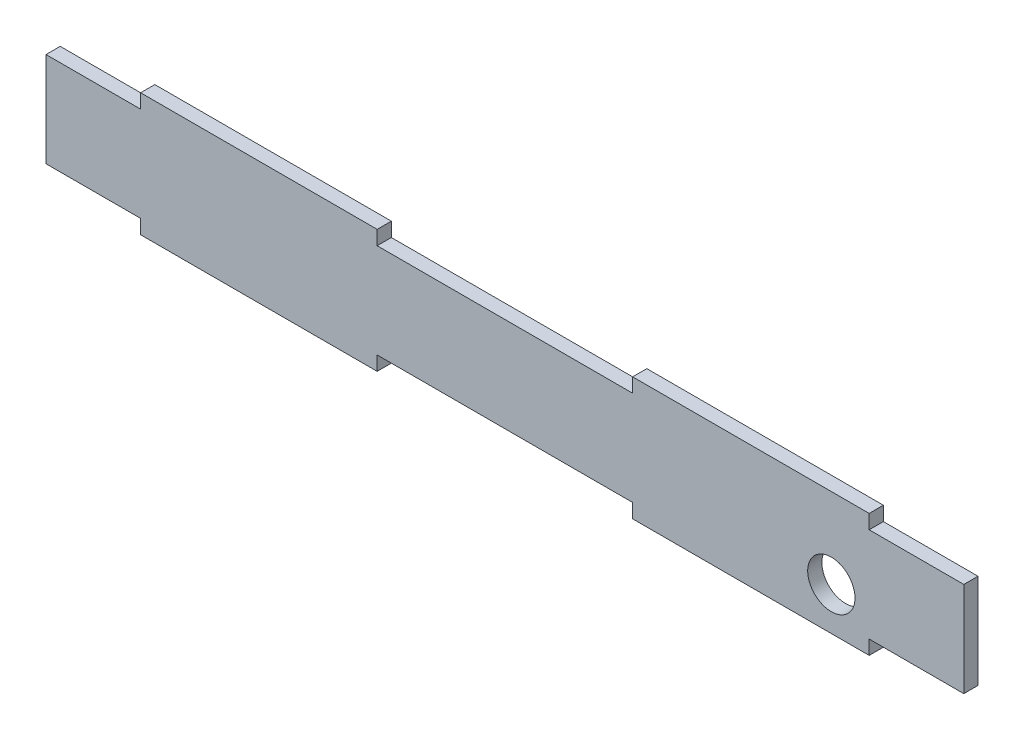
ISO-10303-21;
HEADER;
FILE_DESCRIPTION(('STEP AP214'),'2;1');
FILE_NAME('part.step','',(''),(''),'','','');
FILE_SCHEMA(('AUTOMOTIVE_DESIGN { 1 0 10303 214 1 1 1 1 }'));
ENDSEC;
DATA;
#1=APPLICATION_CONTEXT('core data for automotive mechanical design processes');
#2=APPLICATION_PROTOCOL_DEFINITION('international standard','automotive_design',2000,#1);
#3=PRODUCT_CONTEXT('',#1,'mechanical');
#4=PRODUCT('Part','Part','',(#3));
#5=PRODUCT_RELATED_PRODUCT_CATEGORY('part','',(#4));
#6=PRODUCT_DEFINITION_FORMATION('','',#4);
#7=PRODUCT_DEFINITION_CONTEXT('part definition',#1,'design');
#8=PRODUCT_DEFINITION('design','',#6,#7);
#9=PRODUCT_DEFINITION_SHAPE('','',#8);
#10=(LENGTH_UNIT() NAMED_UNIT(*) SI_UNIT(.MILLI.,.METRE.));
#11=(NAMED_UNIT(*) PLANE_ANGLE_UNIT() SI_UNIT($,.RADIAN.));
#12=(NAMED_UNIT(*) SI_UNIT($,.STERADIAN.) SOLID_ANGLE_UNIT());
#13=UNCERTAINTY_MEASURE_WITH_UNIT(LENGTH_MEASURE(1.E-05),#10,'distance_accuracy_value','');
#14=(GEOMETRIC_REPRESENTATION_CONTEXT(3) GLOBAL_UNCERTAINTY_ASSIGNED_CONTEXT((#13)) GLOBAL_UNIT_ASSIGNED_CONTEXT((#10,
#11,#12)) REPRESENTATION_CONTEXT('',''));
#15=CARTESIAN_POINT('',(0.,0.,0.));
#16=DIRECTION('',(0.,0.,1.));
#17=DIRECTION('',(1.,0.,0.));
#18=AXIS2_PLACEMENT_3D('',#15,#16,#17);
#19=CARTESIAN_POINT('',(166.,6.,3.));
#20=DIRECTION('',(0.,0.,-1.));
#21=DIRECTION('',(-1.,0.,0.));
#22=AXIS2_PLACEMENT_3D('',#19,#20,#21);
#23=CYLINDRICAL_SURFACE('',#22,5.00000000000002);
#24=CARTESIAN_POINT('',(166.,6.,3.));
#25=DIRECTION('',(0.,0.,1.));
#26=DIRECTION('',(1.,0.,0.));
#27=AXIS2_PLACEMENT_3D('',#24,#25,#26);
#28=CIRCLE('',#27,5.00000000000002);
#29=CARTESIAN_POINT('',(171.,6.,3.));
#30=VERTEX_POINT('',#29);
#31=EDGE_CURVE('E640',#30,#30,#28,.T.);
#32=ORIENTED_EDGE('',*,*,#31,.T.);
#33=EDGE_LOOP('',(#32));
#34=FACE_BOUND('',#33,.T.);
#35=CARTESIAN_POINT('',(166.,6.,0.));
#36=DIRECTION('',(0.,0.,1.));
#37=DIRECTION('',(1.,0.,0.));
#38=AXIS2_PLACEMENT_3D('',#35,#36,#37);
#39=CIRCLE('',#38,5.00000000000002);
#40=CARTESIAN_POINT('',(171.,6.,0.));
#41=VERTEX_POINT('',#40);
#42=EDGE_CURVE('E269',#41,#41,#39,.T.);
#43=ORIENTED_EDGE('',*,*,#42,.F.);
#44=EDGE_LOOP('',(#43));
#45=FACE_BOUND('',#44,.T.);
#46=ADVANCED_FACE('F97',(#34,#45),#23,.F.);
#47=CARTESIAN_POINT('',(0.,0.,3.));
#48=DIRECTION('',(-1.,0.,0.));
#49=DIRECTION('',(0.,0.,1.));
#50=AXIS2_PLACEMENT_3D('',#47,#48,#49);
#51=PLANE('',#50);
#52=DIRECTION('',(0.,1.,0.));
#53=VECTOR('',#52,1.);
#54=CARTESIAN_POINT('',(0.,0.,0.));
#55=LINE('',#54,#53);
#56=CARTESIAN_POINT('',(0.,0.,0.));
#57=VERTEX_POINT('',#56);
#58=CARTESIAN_POINT('',(0.,20.,0.));
#59=VERTEX_POINT('',#58);
#60=EDGE_CURVE('E266',#57,#59,#55,.T.);
#61=ORIENTED_EDGE('',*,*,#60,.F.);
#62=DIRECTION('',(0.,0.,-1.));
#63=VECTOR('',#62,1.);
#64=CARTESIAN_POINT('',(0.,0.,3.));
#65=LINE('',#64,#63);
#66=CARTESIAN_POINT('',(0.,0.,3.));
#67=VERTEX_POINT('',#66);
#68=EDGE_CURVE('E281',#67,#57,#65,.T.);
#69=ORIENTED_EDGE('',*,*,#68,.F.);
#70=DIRECTION('',(0.,1.,0.));
#71=VECTOR('',#70,1.);
#72=CARTESIAN_POINT('',(0.,0.,3.));
#73=LINE('',#72,#71);
#74=CARTESIAN_POINT('',(0.,20.,3.));
#75=VERTEX_POINT('',#74);
#76=EDGE_CURVE('E277',#67,#75,#73,.T.);
#77=ORIENTED_EDGE('',*,*,#76,.T.);
#78=DIRECTION('',(0.,0.,-1.));
#79=VECTOR('',#78,1.);
#80=CARTESIAN_POINT('',(0.,20.,3.));
#81=LINE('',#80,#79);
#82=EDGE_CURVE('E299',#75,#59,#81,.T.);
#83=ORIENTED_EDGE('',*,*,#82,.T.);
#84=EDGE_LOOP('',(#61,#69,#77,#83));
#85=FACE_BOUND('',#84,.T.);
#86=ADVANCED_FACE('F375',(#85),#51,.T.);
#87=CARTESIAN_POINT('',(194.,0.,3.));
#88=DIRECTION('',(-1.,0.,0.));
#89=DIRECTION('',(0.,0.,1.));
#90=AXIS2_PLACEMENT_3D('',#87,#88,#89);
#91=PLANE('',#90);
#92=DIRECTION('',(0.,1.,0.));
#93=VECTOR('',#92,1.);
#94=CARTESIAN_POINT('',(194.,0.,0.));
#95=LINE('',#94,#93);
#96=CARTESIAN_POINT('',(194.,0.,0.));
#97=VERTEX_POINT('',#96);
#98=CARTESIAN_POINT('',(194.,20.,0.));
#99=VERTEX_POINT('',#98);
#100=EDGE_CURVE('E285',#97,#99,#95,.T.);
#101=ORIENTED_EDGE('',*,*,#100,.T.);
#102=DIRECTION('',(0.,0.,-1.));
#103=VECTOR('',#102,1.);
#104=CARTESIAN_POINT('',(194.,20.,3.));
#105=LINE('',#104,#103);
#106=CARTESIAN_POINT('',(194.,20.,3.));
#107=VERTEX_POINT('',#106);
#108=EDGE_CURVE('E302',#107,#99,#105,.T.);
#109=ORIENTED_EDGE('',*,*,#108,.F.);
#110=DIRECTION('',(0.,1.,0.));
#111=VECTOR('',#110,1.);
#112=CARTESIAN_POINT('',(194.,0.,3.));
#113=LINE('',#112,#111);
#114=CARTESIAN_POINT('',(194.,0.,3.));
#115=VERTEX_POINT('',#114);
#116=EDGE_CURVE('E264',#115,#107,#113,.T.);
#117=ORIENTED_EDGE('',*,*,#116,.F.);
#118=DIRECTION('',(0.,0.,-1.));
#119=VECTOR('',#118,1.);
#120=CARTESIAN_POINT('',(194.,0.,3.));
#121=LINE('',#120,#119);
#122=EDGE_CURVE('E245',#115,#97,#121,.T.);
#123=ORIENTED_EDGE('',*,*,#122,.T.);
#124=EDGE_LOOP('',(#101,#109,#117,#123));
#125=FACE_BOUND('',#124,.T.);
#126=ADVANCED_FACE('F439',(#125),#91,.F.);
#127=CARTESIAN_POINT('',(0.,0.,0.));
#128=DIRECTION('',(0.,0.,1.));
#129=DIRECTION('',(1.,0.,0.));
#130=AXIS2_PLACEMENT_3D('',#127,#128,#129);
#131=PLANE('',#130);
#132=DIRECTION('',(1.,0.,0.));
#133=VECTOR('',#132,1.);
#134=CARTESIAN_POINT('',(0.,0.,0.));
#135=LINE('',#134,#133);
#136=CARTESIAN_POINT('',(20.,0.,0.));
#137=VERTEX_POINT('',#136);
#138=EDGE_CURVE('E282',#57,#137,#135,.T.);
#139=ORIENTED_EDGE('',*,*,#138,.F.);
#140=ORIENTED_EDGE('',*,*,#60,.T.);
#141=DIRECTION('',(1.,0.,0.));
#142=VECTOR('',#141,1.);
#143=CARTESIAN_POINT('',(0.,20.,0.));
#144=LINE('',#143,#142);
#145=CARTESIAN_POINT('',(20.,20.,0.));
#146=VERTEX_POINT('',#145);
#147=EDGE_CURVE('E291',#59,#146,#144,.T.);
#148=ORIENTED_EDGE('',*,*,#147,.T.);
#149=DIRECTION('',(0.,1.,0.));
#150=VECTOR('',#149,1.);
#151=CARTESIAN_POINT('',(20.,20.,0.));
#152=LINE('',#151,#150);
#153=CARTESIAN_POINT('',(20.,23.,0.));
#154=VERTEX_POINT('',#153);
#155=EDGE_CURVE('E220',#146,#154,#152,.T.);
#156=ORIENTED_EDGE('',*,*,#155,.T.);
#157=DIRECTION('',(1.,0.,0.));
#158=VECTOR('',#157,1.);
#159=CARTESIAN_POINT('',(20.,23.,0.));
#160=LINE('',#159,#158);
#161=CARTESIAN_POINT('',(70.,23.,0.));
#162=VERTEX_POINT('',#161);
#163=EDGE_CURVE('E319',#154,#162,#160,.T.);
#164=ORIENTED_EDGE('',*,*,#163,.T.);
#165=DIRECTION('',(0.,1.,0.));
#166=VECTOR('',#165,1.);
#167=CARTESIAN_POINT('',(70.,20.,0.));
#168=LINE('',#167,#166);
#169=CARTESIAN_POINT('',(70.,20.,0.));
#170=VERTEX_POINT('',#169);
#171=EDGE_CURVE('E311',#170,#162,#168,.T.);
#172=ORIENTED_EDGE('',*,*,#171,.F.);
#173=CARTESIAN_POINT('',(124.,20.,0.));
#174=VERTEX_POINT('',#173);
#175=EDGE_CURVE('E294',#170,#174,#144,.T.);
#176=ORIENTED_EDGE('',*,*,#175,.T.);
#177=DIRECTION('',(0.,1.,0.));
#178=VECTOR('',#177,1.);
#179=CARTESIAN_POINT('',(124.,20.,0.));
#180=LINE('',#179,#178);
#181=CARTESIAN_POINT('',(124.,23.,0.));
#182=VERTEX_POINT('',#181);
#183=EDGE_CURVE('E225',#174,#182,#180,.T.);
#184=ORIENTED_EDGE('',*,*,#183,.T.);
#185=DIRECTION('',(-1.,0.,0.));
#186=VECTOR('',#185,1.);
#187=CARTESIAN_POINT('',(174.,23.,0.));
#188=LINE('',#187,#186);
#189=CARTESIAN_POINT('',(174.,23.,0.));
#190=VERTEX_POINT('',#189);
#191=EDGE_CURVE('E233',#190,#182,#188,.T.);
#192=ORIENTED_EDGE('',*,*,#191,.F.);
#193=DIRECTION('',(0.,1.,0.));
#194=VECTOR('',#193,1.);
#195=CARTESIAN_POINT('',(174.,20.,0.));
#196=LINE('',#195,#194);
#197=CARTESIAN_POINT('',(174.,20.,0.));
#198=VERTEX_POINT('',#197);
#199=EDGE_CURVE('E182',#198,#190,#196,.T.);
#200=ORIENTED_EDGE('',*,*,#199,.F.);
#201=EDGE_CURVE('E290',#198,#99,#144,.T.);
#202=ORIENTED_EDGE('',*,*,#201,.T.);
#203=ORIENTED_EDGE('',*,*,#100,.F.);
#204=CARTESIAN_POINT('',(174.,0.,0.));
#205=VERTEX_POINT('',#204);
#206=EDGE_CURVE('E287',#205,#97,#135,.T.);
#207=ORIENTED_EDGE('',*,*,#206,.F.);
#208=DIRECTION('',(0.,-1.,0.));
#209=VECTOR('',#208,1.);
#210=CARTESIAN_POINT('',(174.,0.,0.));
#211=LINE('',#210,#209);
#212=CARTESIAN_POINT('',(174.,-3.,0.));
#213=VERTEX_POINT('',#212);
#214=EDGE_CURVE('E198',#205,#213,#211,.T.);
#215=ORIENTED_EDGE('',*,*,#214,.T.);
#216=DIRECTION('',(-1.,0.,0.));
#217=VECTOR('',#216,1.);
#218=CARTESIAN_POINT('',(174.,-3.,0.));
#219=LINE('',#218,#217);
#220=CARTESIAN_POINT('',(124.,-3.,0.));
#221=VERTEX_POINT('',#220);
#222=EDGE_CURVE('E176',#213,#221,#219,.T.);
#223=ORIENTED_EDGE('',*,*,#222,.T.);
#224=DIRECTION('',(0.,-1.,0.));
#225=VECTOR('',#224,1.);
#226=CARTESIAN_POINT('',(124.,0.,0.));
#227=LINE('',#226,#225);
#228=CARTESIAN_POINT('',(124.,0.,0.));
#229=VERTEX_POINT('',#228);
#230=EDGE_CURVE('E185',#229,#221,#227,.T.);
#231=ORIENTED_EDGE('',*,*,#230,.F.);
#232=CARTESIAN_POINT('',(69.9999999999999,0.,0.));
#233=VERTEX_POINT('',#232);
#234=EDGE_CURVE('E286',#233,#229,#135,.T.);
#235=ORIENTED_EDGE('',*,*,#234,.F.);
#236=DIRECTION('',(0.,-1.,0.));
#237=VECTOR('',#236,1.);
#238=CARTESIAN_POINT('',(70.,0.,0.));
#239=LINE('',#238,#237);
#240=CARTESIAN_POINT('',(70.,-3.,0.));
#241=VERTEX_POINT('',#240);
#242=EDGE_CURVE('E335',#233,#241,#239,.T.);
#243=ORIENTED_EDGE('',*,*,#242,.T.);
#244=DIRECTION('',(1.,0.,0.));
#245=VECTOR('',#244,1.);
#246=CARTESIAN_POINT('',(20.,-3.,0.));
#247=LINE('',#246,#245);
#248=CARTESIAN_POINT('',(20.,-3.,0.));
#249=VERTEX_POINT('',#248);
#250=EDGE_CURVE('E340',#249,#241,#247,.T.);
#251=ORIENTED_EDGE('',*,*,#250,.F.);
#252=DIRECTION('',(0.,-1.,0.));
#253=VECTOR('',#252,1.);
#254=CARTESIAN_POINT('',(20.,0.,0.));
#255=LINE('',#254,#253);
#256=EDGE_CURVE('E250',#137,#249,#255,.T.);
#257=ORIENTED_EDGE('',*,*,#256,.F.);
#258=EDGE_LOOP('',(#139,#140,#148,#156,#164,#172,#176,#184,#192,#200,#202,#203,#207,#215,#223,
#231,#235,#243,#251,#257));
#259=FACE_BOUND('',#258,.T.);
#260=ORIENTED_EDGE('',*,*,#42,.T.);
#261=EDGE_LOOP('',(#260));
#262=FACE_BOUND('',#261,.T.);
#263=ADVANCED_FACE('F195',(#259,#262),#131,.F.);
#264=CARTESIAN_POINT('',(0.,0.,3.));
#265=DIRECTION('',(0.,0.,1.));
#266=DIRECTION('',(1.,0.,0.));
#267=AXIS2_PLACEMENT_3D('',#264,#265,#266);
#268=PLANE('',#267);
#269=DIRECTION('',(1.,0.,0.));
#270=VECTOR('',#269,1.);
#271=CARTESIAN_POINT('',(0.,0.,3.));
#272=LINE('',#271,#270);
#273=CARTESIAN_POINT('',(20.,0.,3.));
#274=VERTEX_POINT('',#273);
#275=EDGE_CURVE('E261',#67,#274,#272,.T.);
#276=ORIENTED_EDGE('',*,*,#275,.T.);
#277=DIRECTION('',(0.,-1.,0.));
#278=VECTOR('',#277,1.);
#279=CARTESIAN_POINT('',(20.,0.,3.));
#280=LINE('',#279,#278);
#281=CARTESIAN_POINT('',(20.,-3.,3.));
#282=VERTEX_POINT('',#281);
#283=EDGE_CURVE('E331',#274,#282,#280,.T.);
#284=ORIENTED_EDGE('',*,*,#283,.T.);
#285=DIRECTION('',(1.,0.,0.));
#286=VECTOR('',#285,1.);
#287=CARTESIAN_POINT('',(20.,-3.,3.));
#288=LINE('',#287,#286);
#289=CARTESIAN_POINT('',(70.,-3.,3.));
#290=VERTEX_POINT('',#289);
#291=EDGE_CURVE('E334',#282,#290,#288,.T.);
#292=ORIENTED_EDGE('',*,*,#291,.T.);
#293=DIRECTION('',(0.,-1.,0.));
#294=VECTOR('',#293,1.);
#295=CARTESIAN_POINT('',(70.,0.,3.));
#296=LINE('',#295,#294);
#297=CARTESIAN_POINT('',(69.9999999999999,0.,3.));
#298=VERTEX_POINT('',#297);
#299=EDGE_CURVE('E217',#298,#290,#296,.T.);
#300=ORIENTED_EDGE('',*,*,#299,.F.);
#301=CARTESIAN_POINT('',(124.,0.,3.));
#302=VERTEX_POINT('',#301);
#303=EDGE_CURVE('E259',#298,#302,#272,.T.);
#304=ORIENTED_EDGE('',*,*,#303,.T.);
#305=DIRECTION('',(0.,-1.,0.));
#306=VECTOR('',#305,1.);
#307=CARTESIAN_POINT('',(124.,0.,3.));
#308=LINE('',#307,#306);
#309=CARTESIAN_POINT('',(124.,-3.,3.));
#310=VERTEX_POINT('',#309);
#311=EDGE_CURVE('E252',#302,#310,#308,.T.);
#312=ORIENTED_EDGE('',*,*,#311,.T.);
#313=DIRECTION('',(-1.,0.,0.));
#314=VECTOR('',#313,1.);
#315=CARTESIAN_POINT('',(174.,-3.,3.));
#316=LINE('',#315,#314);
#317=CARTESIAN_POINT('',(174.,-3.,3.));
#318=VERTEX_POINT('',#317);
#319=EDGE_CURVE('E179',#318,#310,#316,.T.);
#320=ORIENTED_EDGE('',*,*,#319,.F.);
#321=DIRECTION('',(0.,-1.,0.));
#322=VECTOR('',#321,1.);
#323=CARTESIAN_POINT('',(174.,0.,3.));
#324=LINE('',#323,#322);
#325=CARTESIAN_POINT('',(174.,0.,3.));
#326=VERTEX_POINT('',#325);
#327=EDGE_CURVE('E192',#326,#318,#324,.T.);
#328=ORIENTED_EDGE('',*,*,#327,.F.);
#329=EDGE_CURVE('E262',#326,#115,#272,.T.);
#330=ORIENTED_EDGE('',*,*,#329,.T.);
#331=ORIENTED_EDGE('',*,*,#116,.T.);
#332=DIRECTION('',(1.,0.,0.));
#333=VECTOR('',#332,1.);
#334=CARTESIAN_POINT('',(0.,20.,3.));
#335=LINE('',#334,#333);
#336=CARTESIAN_POINT('',(174.,20.,3.));
#337=VERTEX_POINT('',#336);
#338=EDGE_CURVE('E273',#337,#107,#335,.T.);
#339=ORIENTED_EDGE('',*,*,#338,.F.);
#340=DIRECTION('',(0.,1.,0.));
#341=VECTOR('',#340,1.);
#342=CARTESIAN_POINT('',(174.,20.,3.));
#343=LINE('',#342,#341);
#344=CARTESIAN_POINT('',(174.,23.,3.));
#345=VERTEX_POINT('',#344);
#346=EDGE_CURVE('E221',#337,#345,#343,.T.);
#347=ORIENTED_EDGE('',*,*,#346,.T.);
#348=DIRECTION('',(-1.,0.,0.));
#349=VECTOR('',#348,1.);
#350=CARTESIAN_POINT('',(174.,23.,3.));
#351=LINE('',#350,#349);
#352=CARTESIAN_POINT('',(124.,23.,3.));
#353=VERTEX_POINT('',#352);
#354=EDGE_CURVE('E224',#345,#353,#351,.T.);
#355=ORIENTED_EDGE('',*,*,#354,.T.);
#356=DIRECTION('',(0.,1.,0.));
#357=VECTOR('',#356,1.);
#358=CARTESIAN_POINT('',(124.,20.,3.));
#359=LINE('',#358,#357);
#360=CARTESIAN_POINT('',(124.,20.,3.));
#361=VERTEX_POINT('',#360);
#362=EDGE_CURVE('E227',#361,#353,#359,.T.);
#363=ORIENTED_EDGE('',*,*,#362,.F.);
#364=CARTESIAN_POINT('',(70.,20.,3.));
#365=VERTEX_POINT('',#364);
#366=EDGE_CURVE('E278',#365,#361,#335,.T.);
#367=ORIENTED_EDGE('',*,*,#366,.F.);
#368=DIRECTION('',(0.,1.,0.));
#369=VECTOR('',#368,1.);
#370=CARTESIAN_POINT('',(70.,20.,3.));
#371=LINE('',#370,#369);
#372=CARTESIAN_POINT('',(70.,23.,3.));
#373=VERTEX_POINT('',#372);
#374=EDGE_CURVE('E314',#365,#373,#371,.T.);
#375=ORIENTED_EDGE('',*,*,#374,.T.);
#376=DIRECTION('',(1.,0.,0.));
#377=VECTOR('',#376,1.);
#378=CARTESIAN_POINT('',(20.,23.,3.));
#379=LINE('',#378,#377);
#380=CARTESIAN_POINT('',(20.,23.,3.));
#381=VERTEX_POINT('',#380);
#382=EDGE_CURVE('E310',#381,#373,#379,.T.);
#383=ORIENTED_EDGE('',*,*,#382,.F.);
#384=DIRECTION('',(0.,1.,0.));
#385=VECTOR('',#384,1.);
#386=CARTESIAN_POINT('',(20.,20.,3.));
#387=LINE('',#386,#385);
#388=CARTESIAN_POINT('',(20.,20.,3.));
#389=VERTEX_POINT('',#388);
#390=EDGE_CURVE('E307',#389,#381,#387,.T.);
#391=ORIENTED_EDGE('',*,*,#390,.F.);
#392=EDGE_CURVE('E274',#75,#389,#335,.T.);
#393=ORIENTED_EDGE('',*,*,#392,.F.);
#394=ORIENTED_EDGE('',*,*,#76,.F.);
#395=EDGE_LOOP('',(#276,#284,#292,#300,#304,#312,#320,#328,#330,#331,#339,#347,#355,#363,#367,
#375,#383,#391,#393,#394));
#396=FACE_BOUND('',#395,.T.);
#397=ORIENTED_EDGE('',*,*,#31,.F.);
#398=EDGE_LOOP('',(#397));
#399=FACE_BOUND('',#398,.T.);
#400=ADVANCED_FACE('F256',(#396,#399),#268,.T.);
#401=CARTESIAN_POINT('',(0.,20.,3.));
#402=DIRECTION('',(0.,1.,0.));
#403=DIRECTION('',(0.,0.,1.));
#404=AXIS2_PLACEMENT_3D('',#401,#402,#403);
#405=PLANE('',#404);
#406=DIRECTION('',(0.,0.,-1.));
#407=VECTOR('',#406,1.);
#408=CARTESIAN_POINT('',(70.,20.,3.));
#409=LINE('',#408,#407);
#410=EDGE_CURVE('E204',#365,#170,#409,.T.);
#411=ORIENTED_EDGE('',*,*,#410,.F.);
#412=ORIENTED_EDGE('',*,*,#366,.T.);
#413=DIRECTION('',(0.,0.,-1.));
#414=VECTOR('',#413,1.);
#415=CARTESIAN_POINT('',(124.,20.,3.));
#416=LINE('',#415,#414);
#417=EDGE_CURVE('E242',#361,#174,#416,.T.);
#418=ORIENTED_EDGE('',*,*,#417,.T.);
#419=ORIENTED_EDGE('',*,*,#175,.F.);
#420=EDGE_LOOP('',(#411,#412,#418,#419));
#421=FACE_BOUND('',#420,.T.);
#422=ADVANCED_FACE('F425',(#421),#405,.T.);
#423=DIRECTION('',(0.,0.,-1.));
#424=VECTOR('',#423,1.);
#425=CARTESIAN_POINT('',(174.,20.,3.));
#426=LINE('',#425,#424);
#427=EDGE_CURVE('E238',#337,#198,#426,.T.);
#428=ORIENTED_EDGE('',*,*,#427,.F.);
#429=ORIENTED_EDGE('',*,*,#338,.T.);
#430=ORIENTED_EDGE('',*,*,#108,.T.);
#431=ORIENTED_EDGE('',*,*,#201,.F.);
#432=EDGE_LOOP('',(#428,#429,#430,#431));
#433=FACE_BOUND('',#432,.T.);
#434=ADVANCED_FACE('F414',(#433),#405,.T.);
#435=ORIENTED_EDGE('',*,*,#392,.T.);
#436=DIRECTION('',(0.,0.,-1.));
#437=VECTOR('',#436,1.);
#438=CARTESIAN_POINT('',(20.,20.,3.));
#439=LINE('',#438,#437);
#440=EDGE_CURVE('E241',#389,#146,#439,.T.);
#441=ORIENTED_EDGE('',*,*,#440,.T.);
#442=ORIENTED_EDGE('',*,*,#147,.F.);
#443=ORIENTED_EDGE('',*,*,#82,.F.);
#444=EDGE_LOOP('',(#435,#441,#442,#443));
#445=FACE_BOUND('',#444,.T.);
#446=ADVANCED_FACE('F473',(#445),#405,.T.);
#447=CARTESIAN_POINT('',(0.,0.,3.));
#448=DIRECTION('',(0.,1.,0.));
#449=DIRECTION('',(0.,0.,1.));
#450=AXIS2_PLACEMENT_3D('',#447,#448,#449);
#451=PLANE('',#450);
#452=ORIENTED_EDGE('',*,*,#329,.F.);
#453=DIRECTION('',(0.,0.,-1.));
#454=VECTOR('',#453,1.);
#455=CARTESIAN_POINT('',(174.,0.,3.));
#456=LINE('',#455,#454);
#457=EDGE_CURVE('E116',#326,#205,#456,.T.);
#458=ORIENTED_EDGE('',*,*,#457,.T.);
#459=ORIENTED_EDGE('',*,*,#206,.T.);
#460=ORIENTED_EDGE('',*,*,#122,.F.);
#461=EDGE_LOOP('',(#452,#458,#459,#460));
#462=FACE_BOUND('',#461,.T.);
#463=ADVANCED_FACE('F443',(#462),#451,.F.);
#464=ORIENTED_EDGE('',*,*,#303,.F.);
#465=DIRECTION('',(0.,0.,-1.));
#466=VECTOR('',#465,1.);
#467=CARTESIAN_POINT('',(70.,0.,3.));
#468=LINE('',#467,#466);
#469=EDGE_CURVE('E107',#298,#233,#468,.T.);
#470=ORIENTED_EDGE('',*,*,#469,.T.);
#471=ORIENTED_EDGE('',*,*,#234,.T.);
#472=DIRECTION('',(0.,0.,-1.));
#473=VECTOR('',#472,1.);
#474=CARTESIAN_POINT('',(124.,0.,3.));
#475=LINE('',#474,#473);
#476=EDGE_CURVE('E188',#302,#229,#475,.T.);
#477=ORIENTED_EDGE('',*,*,#476,.F.);
#478=EDGE_LOOP('',(#464,#470,#471,#477));
#479=FACE_BOUND('',#478,.T.);
#480=ADVANCED_FACE('F478',(#479),#451,.F.);
#481=DIRECTION('',(0.,0.,-1.));
#482=VECTOR('',#481,1.);
#483=CARTESIAN_POINT('',(20.,0.,3.));
#484=LINE('',#483,#482);
#485=EDGE_CURVE('E12',#274,#137,#484,.T.);
#486=ORIENTED_EDGE('',*,*,#485,.F.);
#487=ORIENTED_EDGE('',*,*,#275,.F.);
#488=ORIENTED_EDGE('',*,*,#68,.T.);
#489=ORIENTED_EDGE('',*,*,#138,.T.);
#490=EDGE_LOOP('',(#486,#487,#488,#489));
#491=FACE_BOUND('',#490,.T.);
#492=ADVANCED_FACE('F361',(#491),#451,.F.);
#493=CARTESIAN_POINT('',(174.,23.,3.));
#494=DIRECTION('',(0.,-1.,0.));
#495=DIRECTION('',(0.,0.,-1.));
#496=AXIS2_PLACEMENT_3D('',#493,#494,#495);
#497=PLANE('',#496);
#498=ORIENTED_EDGE('',*,*,#191,.T.);
#499=DIRECTION('',(0.,0.,-1.));
#500=VECTOR('',#499,1.);
#501=CARTESIAN_POINT('',(124.,23.,3.));
#502=LINE('',#501,#500);
#503=EDGE_CURVE('E230',#353,#182,#502,.T.);
#504=ORIENTED_EDGE('',*,*,#503,.F.);
#505=ORIENTED_EDGE('',*,*,#354,.F.);
#506=DIRECTION('',(0.,0.,-1.));
#507=VECTOR('',#506,1.);
#508=CARTESIAN_POINT('',(174.,23.,3.));
#509=LINE('',#508,#507);
#510=EDGE_CURVE('E247',#345,#190,#509,.T.);
#511=ORIENTED_EDGE('',*,*,#510,.T.);
#512=EDGE_LOOP('',(#498,#504,#505,#511));
#513=FACE_BOUND('',#512,.T.);
#514=ADVANCED_FACE('F494',(#513),#497,.F.);
#515=CARTESIAN_POINT('',(124.,20.,3.));
#516=DIRECTION('',(-1.,0.,0.));
#517=DIRECTION('',(0.,0.,1.));
#518=AXIS2_PLACEMENT_3D('',#515,#516,#517);
#519=PLANE('',#518);
#520=ORIENTED_EDGE('',*,*,#183,.F.);
#521=ORIENTED_EDGE('',*,*,#417,.F.);
#522=ORIENTED_EDGE('',*,*,#362,.T.);
#523=ORIENTED_EDGE('',*,*,#503,.T.);
#524=EDGE_LOOP('',(#520,#521,#522,#523));
#525=FACE_BOUND('',#524,.T.);
#526=ADVANCED_FACE('F434',(#525),#519,.T.);
#527=CARTESIAN_POINT('',(174.,20.,3.));
#528=DIRECTION('',(-1.,0.,0.));
#529=DIRECTION('',(0.,0.,1.));
#530=AXIS2_PLACEMENT_3D('',#527,#528,#529);
#531=PLANE('',#530);
#532=ORIENTED_EDGE('',*,*,#199,.T.);
#533=ORIENTED_EDGE('',*,*,#510,.F.);
#534=ORIENTED_EDGE('',*,*,#346,.F.);
#535=ORIENTED_EDGE('',*,*,#427,.T.);
#536=EDGE_LOOP('',(#532,#533,#534,#535));
#537=FACE_BOUND('',#536,.T.);
#538=ADVANCED_FACE('F419',(#537),#531,.F.);
#539=CARTESIAN_POINT('',(20.,23.,3.));
#540=DIRECTION('',(0.,1.,0.));
#541=DIRECTION('',(0.,0.,1.));
#542=AXIS2_PLACEMENT_3D('',#539,#540,#541);
#543=PLANE('',#542);
#544=ORIENTED_EDGE('',*,*,#163,.F.);
#545=DIRECTION('',(0.,0.,-1.));
#546=VECTOR('',#545,1.);
#547=CARTESIAN_POINT('',(20.,23.,3.));
#548=LINE('',#547,#546);
#549=EDGE_CURVE('E316',#381,#154,#548,.T.);
#550=ORIENTED_EDGE('',*,*,#549,.F.);
#551=ORIENTED_EDGE('',*,*,#382,.T.);
#552=DIRECTION('',(0.,0.,-1.));
#553=VECTOR('',#552,1.);
#554=CARTESIAN_POINT('',(70.,23.,3.));
#555=LINE('',#554,#553);
#556=EDGE_CURVE('E328',#373,#162,#555,.T.);
#557=ORIENTED_EDGE('',*,*,#556,.T.);
#558=EDGE_LOOP('',(#544,#550,#551,#557));
#559=FACE_BOUND('',#558,.T.);
#560=ADVANCED_FACE('F445',(#559),#543,.T.);
#561=CARTESIAN_POINT('',(20.,20.,3.));
#562=DIRECTION('',(-1.,0.,0.));
#563=DIRECTION('',(0.,0.,1.));
#564=AXIS2_PLACEMENT_3D('',#561,#562,#563);
#565=PLANE('',#564);
#566=ORIENTED_EDGE('',*,*,#155,.F.);
#567=ORIENTED_EDGE('',*,*,#440,.F.);
#568=ORIENTED_EDGE('',*,*,#390,.T.);
#569=ORIENTED_EDGE('',*,*,#549,.T.);
#570=EDGE_LOOP('',(#566,#567,#568,#569));
#571=FACE_BOUND('',#570,.T.);
#572=ADVANCED_FACE('F454',(#571),#565,.T.);
#573=CARTESIAN_POINT('',(70.,20.,3.));
#574=DIRECTION('',(-1.,0.,0.));
#575=DIRECTION('',(0.,0.,1.));
#576=AXIS2_PLACEMENT_3D('',#573,#574,#575);
#577=PLANE('',#576);
#578=ORIENTED_EDGE('',*,*,#171,.T.);
#579=ORIENTED_EDGE('',*,*,#556,.F.);
#580=ORIENTED_EDGE('',*,*,#374,.F.);
#581=ORIENTED_EDGE('',*,*,#410,.T.);
#582=EDGE_LOOP('',(#578,#579,#580,#581));
#583=FACE_BOUND('',#582,.T.);
#584=ADVANCED_FACE('F452',(#583),#577,.F.);
#585=CARTESIAN_POINT('',(174.,-3.,3.));
#586=DIRECTION('',(0.,-1.,0.));
#587=DIRECTION('',(0.,0.,-1.));
#588=AXIS2_PLACEMENT_3D('',#585,#586,#587);
#589=PLANE('',#588);
#590=ORIENTED_EDGE('',*,*,#222,.F.);
#591=DIRECTION('',(0.,0.,-1.));
#592=VECTOR('',#591,1.);
#593=CARTESIAN_POINT('',(174.,-3.,3.));
#594=LINE('',#593,#592);
#595=EDGE_CURVE('E101',#318,#213,#594,.T.);
#596=ORIENTED_EDGE('',*,*,#595,.F.);
#597=ORIENTED_EDGE('',*,*,#319,.T.);
#598=DIRECTION('',(0.,0.,-1.));
#599=VECTOR('',#598,1.);
#600=CARTESIAN_POINT('',(124.,-3.,3.));
#601=LINE('',#600,#599);
#602=EDGE_CURVE('E172',#310,#221,#601,.T.);
#603=ORIENTED_EDGE('',*,*,#602,.T.);
#604=EDGE_LOOP('',(#590,#596,#597,#603));
#605=FACE_BOUND('',#604,.T.);
#606=ADVANCED_FACE('F174',(#605),#589,.T.);
#607=CARTESIAN_POINT('',(174.,0.,3.));
#608=DIRECTION('',(1.,0.,0.));
#609=DIRECTION('',(0.,0.,-1.));
#610=AXIS2_PLACEMENT_3D('',#607,#608,#609);
#611=PLANE('',#610);
#612=ORIENTED_EDGE('',*,*,#214,.F.);
#613=ORIENTED_EDGE('',*,*,#457,.F.);
#614=ORIENTED_EDGE('',*,*,#327,.T.);
#615=ORIENTED_EDGE('',*,*,#595,.T.);
#616=EDGE_LOOP('',(#612,#613,#614,#615));
#617=FACE_BOUND('',#616,.T.);
#618=ADVANCED_FACE('F99',(#617),#611,.T.);
#619=CARTESIAN_POINT('',(124.,0.,3.));
#620=DIRECTION('',(1.,0.,0.));
#621=DIRECTION('',(0.,0.,-1.));
#622=AXIS2_PLACEMENT_3D('',#619,#620,#621);
#623=PLANE('',#622);
#624=ORIENTED_EDGE('',*,*,#230,.T.);
#625=ORIENTED_EDGE('',*,*,#602,.F.);
#626=ORIENTED_EDGE('',*,*,#311,.F.);
#627=ORIENTED_EDGE('',*,*,#476,.T.);
#628=EDGE_LOOP('',(#624,#625,#626,#627));
#629=FACE_BOUND('',#628,.T.);
#630=ADVANCED_FACE('F186',(#629),#623,.F.);
#631=CARTESIAN_POINT('',(20.,-3.,3.));
#632=DIRECTION('',(0.,1.,0.));
#633=DIRECTION('',(0.,0.,1.));
#634=AXIS2_PLACEMENT_3D('',#631,#632,#633);
#635=PLANE('',#634);
#636=ORIENTED_EDGE('',*,*,#250,.T.);
#637=DIRECTION('',(0.,0.,-1.));
#638=VECTOR('',#637,1.);
#639=CARTESIAN_POINT('',(70.,-3.,3.));
#640=LINE('',#639,#638);
#641=EDGE_CURVE('E214',#290,#241,#640,.T.);
#642=ORIENTED_EDGE('',*,*,#641,.F.);
#643=ORIENTED_EDGE('',*,*,#291,.F.);
#644=DIRECTION('',(0.,0.,-1.));
#645=VECTOR('',#644,1.);
#646=CARTESIAN_POINT('',(20.,-3.,3.));
#647=LINE('',#646,#645);
#648=EDGE_CURVE('E216',#282,#249,#647,.T.);
#649=ORIENTED_EDGE('',*,*,#648,.T.);
#650=EDGE_LOOP('',(#636,#642,#643,#649));
#651=FACE_BOUND('',#650,.T.);
#652=ADVANCED_FACE('F450',(#651),#635,.F.);
#653=CARTESIAN_POINT('',(70.,0.,3.));
#654=DIRECTION('',(1.,0.,0.));
#655=DIRECTION('',(0.,0.,-1.));
#656=AXIS2_PLACEMENT_3D('',#653,#654,#655);
#657=PLANE('',#656);
#658=ORIENTED_EDGE('',*,*,#242,.F.);
#659=ORIENTED_EDGE('',*,*,#469,.F.);
#660=ORIENTED_EDGE('',*,*,#299,.T.);
#661=ORIENTED_EDGE('',*,*,#641,.T.);
#662=EDGE_LOOP('',(#658,#659,#660,#661));
#663=FACE_BOUND('',#662,.T.);
#664=ADVANCED_FACE('F345',(#663),#657,.T.);
#665=CARTESIAN_POINT('',(20.,0.,3.));
#666=DIRECTION('',(1.,0.,0.));
#667=DIRECTION('',(0.,0.,-1.));
#668=AXIS2_PLACEMENT_3D('',#665,#666,#667);
#669=PLANE('',#668);
#670=ORIENTED_EDGE('',*,*,#256,.T.);
#671=ORIENTED_EDGE('',*,*,#648,.F.);
#672=ORIENTED_EDGE('',*,*,#283,.F.);
#673=ORIENTED_EDGE('',*,*,#485,.T.);
#674=EDGE_LOOP('',(#670,#671,#672,#673));
#675=FACE_BOUND('',#674,.T.);
#676=ADVANCED_FACE('F366',(#675),#669,.F.);
#677=CLOSED_SHELL('',(#46,#86,#126,#263,#400,#422,#434,#446,#463,#480,#492,#514,#526,#538,#560,
#572,#584,#606,#618,#630,#652,#664,#676));
#678=MANIFOLD_SOLID_BREP('B2',#677);
#679=ADVANCED_BREP_SHAPE_REPRESENTATION('',(#18,#678),#14);
#680=SHAPE_DEFINITION_REPRESENTATION(#9,#679);
ENDSEC;
END-ISO-10303-21;
